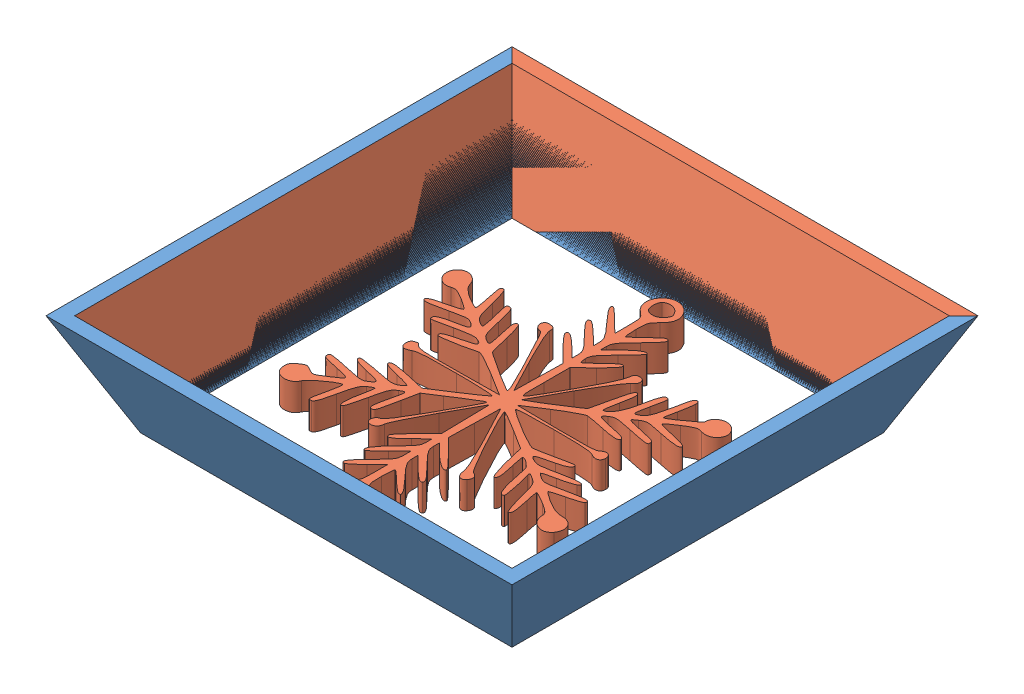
SolidWorks assembly Assembling (5th and 6th).SLDASM, configuration Default (file format 9000). Lengths in mm.
Overall size (68.99 15 68.99).
2 component instances, 2 part files, 1 mates.
Components (placement in the parent):
- 6th (3D Design)-1: 6th (3D Design).SLDPRT [Default] at (-4.0683 68.9892 -1.5256) size (68.99 15 68.99) (hidden)
- snowflake-1: snowflake.SLDPRT [Default] at (-4.8173 72.9892 -0.8685) size (68.99 15 68.99)
Mates (geometry in assembly coordinates):
- Coincident1: coincident: line of 6th (3D Design)-1 through (-31.5683 68.9892 -29.0256) axis (0 0 1); plane of snowflake-1 through (-17.6145 68.9892 3.1135) normal (0 -1 0)
